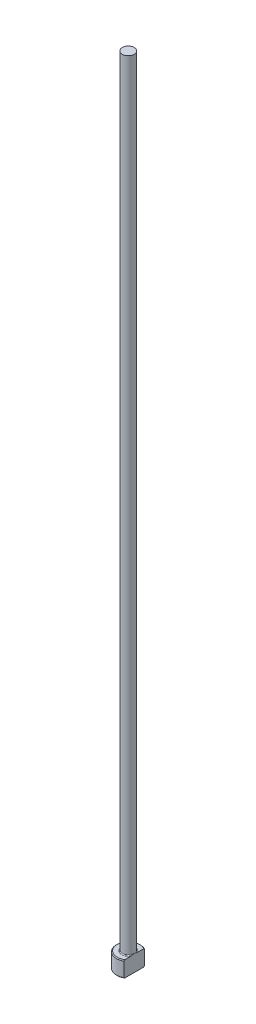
from build123d import *
from build123d.topology import SkipClean

# Parameters (mm, degrees)
CHAMFER1_SIZE    = 0.2
FILLET1_R        = 0.2
KEYED_HEAD_DEPTH = 201.044994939


with BuildPart() as part:
    # Sketch1 → Revolve1 (revolve)
    with BuildSketch(Plane.XY, mode=Mode.PRIVATE) as revolve1_sk:
        Polygon((0, 0), (-3, 0), (-3, 4), (-1.5, 4), (-1.5, 200), (0, 200), align=None)
    revolve(revolve1_sk.sketch.rotate(Axis((0, 259.958771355, 0), (0, -1, 0)), 270), axis=Axis((0, 259.958771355, 0), (0, -1, 0)))

    # Chamfer1
    chamfer1_edges = [part.edges().sort_by_distance(p)[0] for p in [
        (0, 4, -3),
        (0, 0, -3),
    ]]
    chamfer(chamfer1_edges, length=CHAMFER1_SIZE)

    # Fillet1
    fillet1_edges = [part.edges().sort_by_distance(p)[0] for p in [
        (0, 4, -1.5),
    ]]
    fillet(fillet1_edges, radius=FILLET1_R)

    # Sketch2 → KEYED HEAD (cut, through all)
    with SkipClean():  # the faces are left unmerged after this step: merging them gives an invalid solid
        with BuildSketch(Plane(origin=(0, 0, 0), x_dir=(1, 0, 0), z_dir=(0, 1, 0))):
            with BuildLine():
                Line((1.5, -2.598076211), (1.5, 2.598076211))
                ThreePointArc((1.5, 2.598076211), (3, 0), (1.5, -2.598076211))
            make_face()
        extrude(amount=KEYED_HEAD_DEPTH, mode=Mode.SUBTRACT)


solid = part.part
